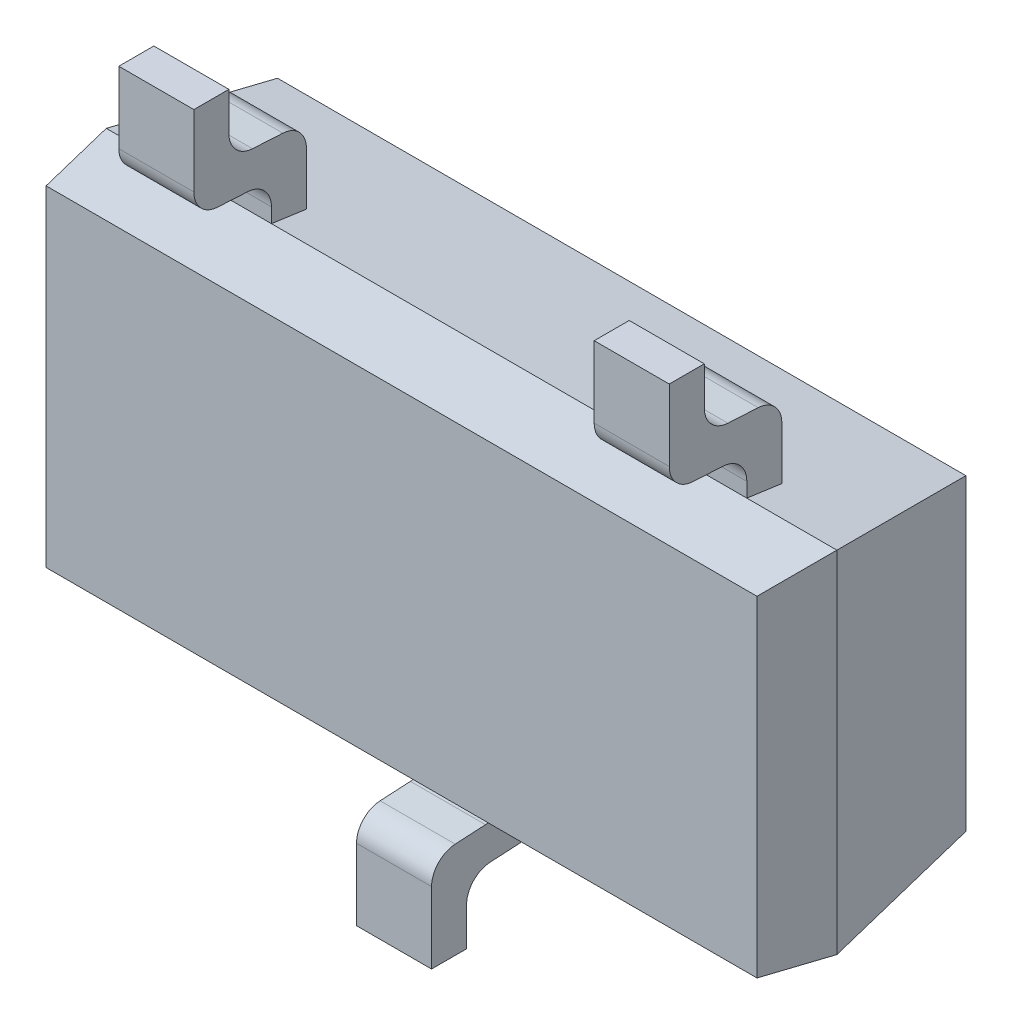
from build123d import *

# Parameters (mm, degrees)
SKETCH1_W            = 2.92
SKETCH1_H            = 1.4
EXTRUDE1_DEPTH       = 0.28
EXTRUDE1_TAPER       = 8
SKETCH2_W            = 2.92
SKETCH2_H            = 1.4
EXTRUDE2_DEPTH       = 0.6
EXTRUDE2_DRAFT       = -8
EXTRUDE3_DEPTH       = 0.15
LPATTERN1_COUNT      = 2
LPATTERN1_PITCH      = 0.95
LPATTERN1_COL_COUNT  = 2
LPATTERN1_COL_PITCH  = 0.95
MIRROR1_COPY_1_DEPTH = 0.15
MIRROR1_COPY_2_DEPTH = 0.15
SKETCH6_W            = 0.703654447
SKETCH6_H            = 1.188246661
CUT_EXTRUDE3_DEPTH   = 1
SKETCH7_W            = 0.6704632
SKETCH7_H            = 1.450457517
CUT_EXTRUDE4_DEPTH   = 1
FILLET1_R            = 0.1


with BuildPart() as part:
    # Sketch1 → Extrude1 (new body)
    with BuildSketch(Plane.XY):
        Rectangle(SKETCH1_W, SKETCH1_H)
    extrude(amount=EXTRUDE1_DEPTH, taper=EXTRUDE1_TAPER)


with BuildPart() as extrude2_tool:
    # Sketch2 → Extrude2 (with draft: the straight prism first)
    with BuildSketch(Plane.XY):
        Rectangle(SKETCH2_W, SKETCH2_H)
    extrude(amount=-EXTRUDE2_DEPTH)
    # Extrude2: the draft: its side faces are tilted about the plane it starts from
    extrude2_sides = [extrude2_tool.faces().sort_by_distance(p)[0] for p in [
        (-1.46, 0, -0.3),
        (0, -0.7, -0.3),
        (1.46, 0, -0.3),
        (0, 0.7, -0.3),
    ]]
    draft(extrude2_sides, Plane.XY, EXTRUDE2_DRAFT)


with BuildPart() as part_1:
    add(part.part)

    # Extrude2: add extrude2_tool
    add(extrude2_tool.part)

    # Sketch3 → Extrude3 (add, symmetric)
    with BuildSketch(Plane(origin=(0, 0, 0), x_dir=(0, 0, -1), z_dir=(1, 0, 0))):
        Polygon((0, 0), (0, 0.852805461), (-0.31, 0.87), (-0.31, 1.25), (-0.17, 1.25), (-0.17, 1.002449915), (0.14, 0.985255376), (0.14, 0), align=None)
    extrude3 = extrude(amount=EXTRUDE3_DEPTH, both=True)

    # LPattern1: Extrude3 ×2
    with Locations(*[(-i * LPATTERN1_PITCH, 0, 0) for i in range(1, LPATTERN1_COUNT)]):
        add(extrude3)

    # LPattern1 col: Extrude3 ×2
    with Locations(*[(i * LPATTERN1_COL_PITCH, 0, 0) for i in range(1, LPATTERN1_COL_COUNT)]):
        add(extrude3)

    # Mirror1: Extrude3 across plane
    add(extrude3.mirror(Plane.ZX))

    # Mirror1 copy 1 sketch → Mirror1 copy 1 (add, symmetric)
    with BuildSketch(Plane(origin=(-0.95, 0, 0), x_dir=(0, 0, -1), z_dir=(1, 0, 0))):
        Polygon((0, 0), (0, -0.852805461), (-0.31, -0.87), (-0.31, -1.25), (-0.17, -1.25), (-0.17, -1.002449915), (0.14, -0.985255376), (0.14, 0), align=None)
    extrude(amount=MIRROR1_COPY_1_DEPTH, both=True)

    # Mirror1 copy 2 sketch → Mirror1 copy 2 (add, symmetric)
    with BuildSketch(Plane(origin=(0.95, 0, 0), x_dir=(0, 0, -1), z_dir=(1, 0, 0))):
        Polygon((0, 0), (0, -0.852805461), (-0.31, -0.87), (-0.31, -1.25), (-0.17, -1.25), (-0.17, -1.002449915), (0.14, -0.985255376), (0.14, 0), align=None)
    extrude(amount=MIRROR1_COPY_2_DEPTH, both=True)

    # Sketch6 → Cut-Extrude3 (cut)
    with BuildSketch(Plane(origin=(0, -0.686441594, -0.096473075), x_dir=(1, 0, 0), z_dir=(0, -0.9902680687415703, -0.13917310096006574))):
        with Locations((0.911099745, 0.294016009)):
            Rectangle(SKETCH6_W, SKETCH6_H)
    cut_extrude3 = extrude(amount=CUT_EXTRUDE3_DEPTH, mode=Mode.SUBTRACT)

    # Mirror2: Cut-Extrude3 across plane
    add(cut_extrude3.mirror(Plane(origin=(0, 0, 0), x_dir=(0, 0, 1), z_dir=(1, 0, 0))), mode=Mode.SUBTRACT)

    # Sketch7 → Cut-Extrude4 (cut)
    with BuildSketch(Plane(origin=(0, 0.686441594, -0.096473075), x_dir=(-1, 0, 0), z_dir=(0, 0.9902680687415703, -0.13917310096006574))):
        with Locations((-0.008297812, 0.431759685)):
            Rectangle(SKETCH7_W, SKETCH7_H)
    extrude(amount=CUT_EXTRUDE4_DEPTH, mode=Mode.SUBTRACT)

    # Fillet1
    fillet1_edges = [part_1.edges().sort_by_distance(p)[0] for p in [
        (0, -0.852805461, 0),
        (0, -0.87, 0.31),
        (0, -1.002449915, 0.17),
        (0, -0.985255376, -0.14),
        (0.95, 0.852805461, 0),
        (0.95, 0.985255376, -0.14),
        (0.95, 1.002449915, 0.17),
        (0.95, 0.87, 0.31),
        (-0.95, 0.852805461, 0),
        (-0.95, 0.985255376, -0.14),
        (-0.95, 1.002449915, 0.17),
        (-0.95, 0.87, 0.31),
    ]]
    fillet(fillet1_edges, radius=FILLET1_R)


solid = part_1.part
